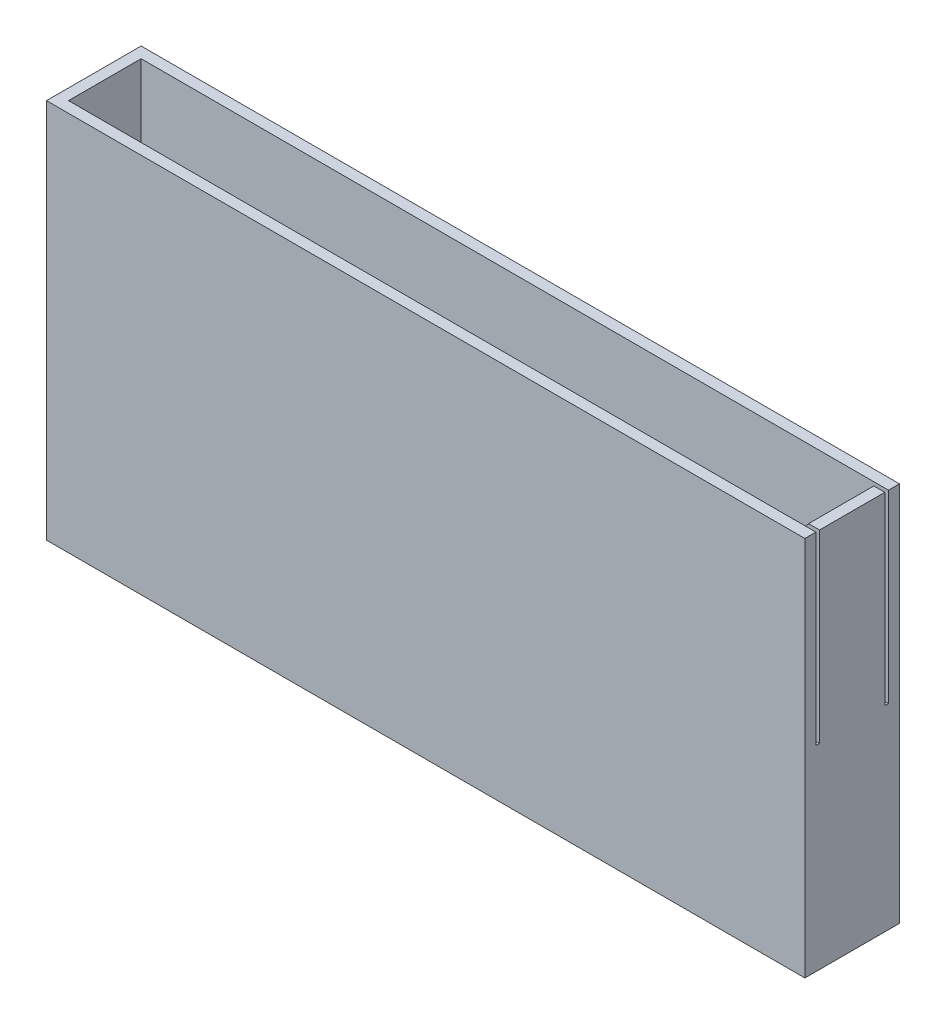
ISO-10303-21;
HEADER;
FILE_DESCRIPTION(('STEP AP214'),'2;1');
FILE_NAME('part.step','',(''),(''),'','','');
FILE_SCHEMA(('AUTOMOTIVE_DESIGN { 1 0 10303 214 1 1 1 1 }'));
ENDSEC;
DATA;
#1=APPLICATION_CONTEXT('core data for automotive mechanical design processes');
#2=APPLICATION_PROTOCOL_DEFINITION('international standard','automotive_design',2000,#1);
#3=PRODUCT_CONTEXT('',#1,'mechanical');
#4=PRODUCT('Part','Part','',(#3));
#5=PRODUCT_RELATED_PRODUCT_CATEGORY('part','',(#4));
#6=PRODUCT_DEFINITION_FORMATION('','',#4);
#7=PRODUCT_DEFINITION_CONTEXT('part definition',#1,'design');
#8=PRODUCT_DEFINITION('design','',#6,#7);
#9=PRODUCT_DEFINITION_SHAPE('','',#8);
#10=(LENGTH_UNIT() NAMED_UNIT(*) SI_UNIT(.MILLI.,.METRE.));
#11=(NAMED_UNIT(*) PLANE_ANGLE_UNIT() SI_UNIT($,.RADIAN.));
#12=(NAMED_UNIT(*) SI_UNIT($,.STERADIAN.) SOLID_ANGLE_UNIT());
#13=UNCERTAINTY_MEASURE_WITH_UNIT(LENGTH_MEASURE(1.E-05),#10,'distance_accuracy_value','');
#14=(GEOMETRIC_REPRESENTATION_CONTEXT(3) GLOBAL_UNCERTAINTY_ASSIGNED_CONTEXT((#13)) GLOBAL_UNIT_ASSIGNED_CONTEXT((#10,
#11,#12)) REPRESENTATION_CONTEXT('',''));
#15=CARTESIAN_POINT('',(0.,0.,0.));
#16=DIRECTION('',(0.,0.,1.));
#17=DIRECTION('',(1.,0.,0.));
#18=AXIS2_PLACEMENT_3D('',#15,#16,#17);
#19=CARTESIAN_POINT('',(0.,50.4,0.));
#20=DIRECTION('',(0.,-1.,0.));
#21=DIRECTION('',(0.,0.,-1.));
#22=AXIS2_PLACEMENT_3D('',#19,#20,#21);
#23=PLANE('',#22);
#24=DIRECTION('',(-1.,0.,0.));
#25=VECTOR('',#24,1.);
#26=CARTESIAN_POINT('',(1.5,50.4,-11.4));
#27=LINE('',#26,#25);
#28=CARTESIAN_POINT('',(103.4,50.4,-11.4));
#29=VERTEX_POINT('',#28);
#30=CARTESIAN_POINT('',(1.5,50.4,-11.4));
#31=VERTEX_POINT('',#30);
#32=EDGE_CURVE('E199',#29,#31,#27,.T.);
#33=ORIENTED_EDGE('',*,*,#32,.F.);
#34=DIRECTION('',(0.,0.,-1.));
#35=VECTOR('',#34,1.);
#36=CARTESIAN_POINT('',(103.4,50.4,0.));
#37=LINE('',#36,#35);
#38=CARTESIAN_POINT('',(103.4,50.4,-12.9));
#39=VERTEX_POINT('',#38);
#40=EDGE_CURVE('E235',#29,#39,#37,.T.);
#41=ORIENTED_EDGE('',*,*,#40,.T.);
#42=DIRECTION('',(-1.,0.,0.));
#43=VECTOR('',#42,1.);
#44=CARTESIAN_POINT('',(0.,50.4,-12.9));
#45=LINE('',#44,#43);
#46=CARTESIAN_POINT('',(0.,50.4,-12.9));
#47=VERTEX_POINT('',#46);
#48=EDGE_CURVE('E229',#39,#47,#45,.T.);
#49=ORIENTED_EDGE('',*,*,#48,.T.);
#50=DIRECTION('',(0.,0.,1.));
#51=VECTOR('',#50,1.);
#52=CARTESIAN_POINT('',(0.,50.4,0.));
#53=LINE('',#52,#51);
#54=CARTESIAN_POINT('',(0.,50.4,0.));
#55=VERTEX_POINT('',#54);
#56=EDGE_CURVE('E238',#47,#55,#53,.T.);
#57=ORIENTED_EDGE('',*,*,#56,.T.);
#58=DIRECTION('',(1.,0.,0.));
#59=VECTOR('',#58,1.);
#60=CARTESIAN_POINT('',(0.,50.4,0.));
#61=LINE('',#60,#59);
#62=CARTESIAN_POINT('',(103.4,50.4,0.));
#63=VERTEX_POINT('',#62);
#64=EDGE_CURVE('E236',#55,#63,#61,.T.);
#65=ORIENTED_EDGE('',*,*,#64,.T.);
#66=CARTESIAN_POINT('',(103.4,50.4,-1.5));
#67=VERTEX_POINT('',#66);
#68=EDGE_CURVE('E231',#63,#67,#37,.T.);
#69=ORIENTED_EDGE('',*,*,#68,.T.);
#70=DIRECTION('',(1.,0.,0.));
#71=VECTOR('',#70,1.);
#72=CARTESIAN_POINT('',(1.5,50.4,-1.5));
#73=LINE('',#72,#71);
#74=CARTESIAN_POINT('',(1.5,50.4,-1.5));
#75=VERTEX_POINT('',#74);
#76=EDGE_CURVE('E200',#75,#67,#73,.T.);
#77=ORIENTED_EDGE('',*,*,#76,.F.);
#78=DIRECTION('',(0.,0.,1.));
#79=VECTOR('',#78,1.);
#80=CARTESIAN_POINT('',(1.5,50.4,-1.5));
#81=LINE('',#80,#79);
#82=EDGE_CURVE('E204',#31,#75,#81,.T.);
#83=ORIENTED_EDGE('',*,*,#82,.F.);
#84=EDGE_LOOP('',(#33,#41,#49,#57,#65,#69,#77,#83));
#85=FACE_BOUND('',#84,.T.);
#86=ADVANCED_FACE('F32',(#85),#23,.F.);
#87=CARTESIAN_POINT('',(0.,0.,0.));
#88=DIRECTION('',(0.,-1.,0.));
#89=DIRECTION('',(0.,0.,-1.));
#90=AXIS2_PLACEMENT_3D('',#87,#88,#89);
#91=PLANE('',#90);
#92=DIRECTION('',(0.,0.,1.));
#93=VECTOR('',#92,1.);
#94=CARTESIAN_POINT('',(10.5,0.,-11.4));
#95=LINE('',#94,#93);
#96=CARTESIAN_POINT('',(10.5,0.,-11.4));
#97=VERTEX_POINT('',#96);
#98=CARTESIAN_POINT('',(10.5,0.,-1.5));
#99=VERTEX_POINT('',#98);
#100=EDGE_CURVE('E290',#97,#99,#95,.T.);
#101=ORIENTED_EDGE('',*,*,#100,.F.);
#102=DIRECTION('',(-1.,0.,0.));
#103=VECTOR('',#102,1.);
#104=CARTESIAN_POINT('',(1.5,0.,-11.4));
#105=LINE('',#104,#103);
#106=CARTESIAN_POINT('',(1.5,0.,-11.4));
#107=VERTEX_POINT('',#106);
#108=EDGE_CURVE('E252',#97,#107,#105,.T.);
#109=ORIENTED_EDGE('',*,*,#108,.T.);
#110=DIRECTION('',(0.,0.,1.));
#111=VECTOR('',#110,1.);
#112=CARTESIAN_POINT('',(1.5,0.,-1.5));
#113=LINE('',#112,#111);
#114=CARTESIAN_POINT('',(1.5,0.,-1.5));
#115=VERTEX_POINT('',#114);
#116=EDGE_CURVE('E208',#107,#115,#113,.T.);
#117=ORIENTED_EDGE('',*,*,#116,.T.);
#118=DIRECTION('',(1.,0.,0.));
#119=VECTOR('',#118,1.);
#120=CARTESIAN_POINT('',(1.5,0.,-1.5));
#121=LINE('',#120,#119);
#122=EDGE_CURVE('E221',#115,#99,#121,.T.);
#123=ORIENTED_EDGE('',*,*,#122,.T.);
#124=EDGE_LOOP('',(#101,#109,#117,#123));
#125=FACE_BOUND('',#124,.T.);
#126=ADVANCED_FACE('F408',(#125),#91,.F.);
#127=DIRECTION('',(0.,0.,-1.));
#128=VECTOR('',#127,1.);
#129=CARTESIAN_POINT('',(92.9,0.,-11.4));
#130=LINE('',#129,#128);
#131=CARTESIAN_POINT('',(92.9,0.,-1.5));
#132=VERTEX_POINT('',#131);
#133=CARTESIAN_POINT('',(92.9,0.,-11.4));
#134=VERTEX_POINT('',#133);
#135=EDGE_CURVE('E287',#132,#134,#130,.T.);
#136=ORIENTED_EDGE('',*,*,#135,.F.);
#137=CARTESIAN_POINT('',(101.9,0.,-1.5));
#138=VERTEX_POINT('',#137);
#139=EDGE_CURVE('E211',#132,#138,#121,.T.);
#140=ORIENTED_EDGE('',*,*,#139,.T.);
#141=DIRECTION('',(0.,0.,-1.));
#142=VECTOR('',#141,1.);
#143=CARTESIAN_POINT('',(101.9,0.,-1.5));
#144=LINE('',#143,#142);
#145=CARTESIAN_POINT('',(101.9,0.,-11.4));
#146=VERTEX_POINT('',#145);
#147=EDGE_CURVE('E215',#138,#146,#144,.T.);
#148=ORIENTED_EDGE('',*,*,#147,.T.);
#149=EDGE_CURVE('E254',#146,#134,#105,.T.);
#150=ORIENTED_EDGE('',*,*,#149,.T.);
#151=EDGE_LOOP('',(#136,#140,#148,#150));
#152=FACE_BOUND('',#151,.T.);
#153=ADVANCED_FACE('F264',(#152),#91,.F.);
#154=CARTESIAN_POINT('',(103.4,50.4,-2.));
#155=VERTEX_POINT('',#154);
#156=CARTESIAN_POINT('',(103.4,50.4,-10.9));
#157=VERTEX_POINT('',#156);
#158=EDGE_CURVE('E234',#155,#157,#37,.T.);
#159=ORIENTED_EDGE('',*,*,#158,.T.);
#160=DIRECTION('',(-1.,0.,0.));
#161=VECTOR('',#160,1.);
#162=CARTESIAN_POINT('',(128.604959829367,50.4,-10.9));
#163=LINE('',#162,#161);
#164=CARTESIAN_POINT('',(101.9,50.4,-10.9));
#165=VERTEX_POINT('',#164);
#166=EDGE_CURVE('E198',#157,#165,#163,.T.);
#167=ORIENTED_EDGE('',*,*,#166,.T.);
#168=DIRECTION('',(0.,0.,-1.));
#169=VECTOR('',#168,1.);
#170=CARTESIAN_POINT('',(101.9,50.4,-1.5));
#171=LINE('',#170,#169);
#172=CARTESIAN_POINT('',(101.9,50.4,-2.));
#173=VERTEX_POINT('',#172);
#174=EDGE_CURVE('E175',#173,#165,#171,.T.);
#175=ORIENTED_EDGE('',*,*,#174,.F.);
#176=DIRECTION('',(-1.,0.,0.));
#177=VECTOR('',#176,1.);
#178=CARTESIAN_POINT('',(128.604959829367,50.4,-2.));
#179=LINE('',#178,#177);
#180=EDGE_CURVE('E185',#155,#173,#179,.T.);
#181=ORIENTED_EDGE('',*,*,#180,.F.);
#182=EDGE_LOOP('',(#159,#167,#175,#181));
#183=FACE_BOUND('',#182,.T.);
#184=ADVANCED_FACE('F197',(#183),#23,.F.);
#185=CARTESIAN_POINT('',(0.,50.4,0.));
#186=DIRECTION('',(1.,0.,0.));
#187=DIRECTION('',(0.,0.,-1.));
#188=AXIS2_PLACEMENT_3D('',#185,#186,#187);
#189=PLANE('',#188);
#190=DIRECTION('',(0.,-1.,0.));
#191=VECTOR('',#190,1.);
#192=CARTESIAN_POINT('',(0.,50.4,-12.9));
#193=LINE('',#192,#191);
#194=CARTESIAN_POINT('',(0.,-1.5,-12.9));
#195=VERTEX_POINT('',#194);
#196=EDGE_CURVE('E227',#47,#195,#193,.T.);
#197=ORIENTED_EDGE('',*,*,#196,.T.);
#198=DIRECTION('',(0.,0.,-1.));
#199=VECTOR('',#198,1.);
#200=CARTESIAN_POINT('',(0.,-1.5,0.));
#201=LINE('',#200,#199);
#202=CARTESIAN_POINT('',(0.,-1.5,0.));
#203=VERTEX_POINT('',#202);
#204=EDGE_CURVE('E306',#203,#195,#201,.T.);
#205=ORIENTED_EDGE('',*,*,#204,.F.);
#206=DIRECTION('',(0.,-1.,0.));
#207=VECTOR('',#206,1.);
#208=CARTESIAN_POINT('',(0.,50.4,0.));
#209=LINE('',#208,#207);
#210=EDGE_CURVE('E11',#55,#203,#209,.T.);
#211=ORIENTED_EDGE('',*,*,#210,.F.);
#212=ORIENTED_EDGE('',*,*,#56,.F.);
#213=EDGE_LOOP('',(#197,#205,#211,#212));
#214=FACE_BOUND('',#213,.T.);
#215=ADVANCED_FACE('F34',(#214),#189,.F.);
#216=CARTESIAN_POINT('',(0.,50.4,0.));
#217=DIRECTION('',(0.,0.,-1.));
#218=DIRECTION('',(-1.,0.,0.));
#219=AXIS2_PLACEMENT_3D('',#216,#217,#218);
#220=PLANE('',#219);
#221=ORIENTED_EDGE('',*,*,#210,.T.);
#222=DIRECTION('',(-1.,0.,0.));
#223=VECTOR('',#222,1.);
#224=CARTESIAN_POINT('',(0.,-1.5,0.));
#225=LINE('',#224,#223);
#226=CARTESIAN_POINT('',(103.4,-1.5,0.));
#227=VERTEX_POINT('',#226);
#228=EDGE_CURVE('E212',#227,#203,#225,.T.);
#229=ORIENTED_EDGE('',*,*,#228,.F.);
#230=DIRECTION('',(0.,-1.,0.));
#231=VECTOR('',#230,1.);
#232=CARTESIAN_POINT('',(103.4,50.4,0.));
#233=LINE('',#232,#231);
#234=EDGE_CURVE('E41',#63,#227,#233,.T.);
#235=ORIENTED_EDGE('',*,*,#234,.F.);
#236=ORIENTED_EDGE('',*,*,#64,.F.);
#237=EDGE_LOOP('',(#221,#229,#235,#236));
#238=FACE_BOUND('',#237,.T.);
#239=ADVANCED_FACE('F345',(#238),#220,.F.);
#240=CARTESIAN_POINT('',(103.4,50.4,0.));
#241=DIRECTION('',(-1.,0.,0.));
#242=DIRECTION('',(0.,0.,1.));
#243=AXIS2_PLACEMENT_3D('',#240,#241,#242);
#244=PLANE('',#243);
#245=ORIENTED_EDGE('',*,*,#40,.F.);
#246=DIRECTION('',(0.,1.,0.));
#247=VECTOR('',#246,1.);
#248=CARTESIAN_POINT('',(103.4,25.2,-11.4));
#249=LINE('',#248,#247);
#250=CARTESIAN_POINT('',(103.4,25.2,-11.4));
#251=VERTEX_POINT('',#250);
#252=EDGE_CURVE('E357',#251,#29,#249,.T.);
#253=ORIENTED_EDGE('',*,*,#252,.F.);
#254=DIRECTION('',(0.,0.,-1.));
#255=VECTOR('',#254,1.);
#256=CARTESIAN_POINT('',(103.4,25.2,-11.4));
#257=LINE('',#256,#255);
#258=CARTESIAN_POINT('',(103.4,25.2,-10.9));
#259=VERTEX_POINT('',#258);
#260=EDGE_CURVE('E354',#259,#251,#257,.T.);
#261=ORIENTED_EDGE('',*,*,#260,.F.);
#262=DIRECTION('',(0.,-1.,0.));
#263=VECTOR('',#262,1.);
#264=CARTESIAN_POINT('',(103.4,25.2,-10.9));
#265=LINE('',#264,#263);
#266=EDGE_CURVE('E353',#157,#259,#265,.T.);
#267=ORIENTED_EDGE('',*,*,#266,.F.);
#268=ORIENTED_EDGE('',*,*,#158,.F.);
#269=DIRECTION('',(0.,1.,0.));
#270=VECTOR('',#269,1.);
#271=CARTESIAN_POINT('',(103.4,25.2,-2.));
#272=LINE('',#271,#270);
#273=CARTESIAN_POINT('',(103.4,25.2,-2.));
#274=VERTEX_POINT('',#273);
#275=EDGE_CURVE('E189',#274,#155,#272,.T.);
#276=ORIENTED_EDGE('',*,*,#275,.F.);
#277=DIRECTION('',(0.,0.,-1.));
#278=VECTOR('',#277,1.);
#279=CARTESIAN_POINT('',(103.4,25.2,-1.5));
#280=LINE('',#279,#278);
#281=CARTESIAN_POINT('',(103.4,25.2,-1.5));
#282=VERTEX_POINT('',#281);
#283=EDGE_CURVE('E376',#282,#274,#280,.T.);
#284=ORIENTED_EDGE('',*,*,#283,.F.);
#285=DIRECTION('',(0.,-1.,0.));
#286=VECTOR('',#285,1.);
#287=CARTESIAN_POINT('',(103.4,25.2,-1.5));
#288=LINE('',#287,#286);
#289=EDGE_CURVE('E293',#67,#282,#288,.T.);
#290=ORIENTED_EDGE('',*,*,#289,.F.);
#291=ORIENTED_EDGE('',*,*,#68,.F.);
#292=ORIENTED_EDGE('',*,*,#234,.T.);
#293=DIRECTION('',(0.,0.,1.));
#294=VECTOR('',#293,1.);
#295=CARTESIAN_POINT('',(103.4,-1.5,0.));
#296=LINE('',#295,#294);
#297=CARTESIAN_POINT('',(103.4,-1.5,-12.9));
#298=VERTEX_POINT('',#297);
#299=EDGE_CURVE('E320',#298,#227,#296,.T.);
#300=ORIENTED_EDGE('',*,*,#299,.F.);
#301=DIRECTION('',(0.,-1.,0.));
#302=VECTOR('',#301,1.);
#303=CARTESIAN_POINT('',(103.4,50.4,-12.9));
#304=LINE('',#303,#302);
#305=EDGE_CURVE('E225',#39,#298,#304,.T.);
#306=ORIENTED_EDGE('',*,*,#305,.F.);
#307=EDGE_LOOP('',(#245,#253,#261,#267,#268,#276,#284,#290,#291,#292,#300,#306));
#308=FACE_BOUND('',#307,.T.);
#309=ADVANCED_FACE('F342',(#308),#244,.F.);
#310=CARTESIAN_POINT('',(0.,50.4,-12.9));
#311=DIRECTION('',(0.,0.,1.));
#312=DIRECTION('',(1.,0.,0.));
#313=AXIS2_PLACEMENT_3D('',#310,#311,#312);
#314=PLANE('',#313);
#315=ORIENTED_EDGE('',*,*,#305,.T.);
#316=DIRECTION('',(1.,0.,0.));
#317=VECTOR('',#316,1.);
#318=CARTESIAN_POINT('',(0.,-1.5,-12.9));
#319=LINE('',#318,#317);
#320=EDGE_CURVE('E310',#195,#298,#319,.T.);
#321=ORIENTED_EDGE('',*,*,#320,.F.);
#322=ORIENTED_EDGE('',*,*,#196,.F.);
#323=ORIENTED_EDGE('',*,*,#48,.F.);
#324=EDGE_LOOP('',(#315,#321,#322,#323));
#325=FACE_BOUND('',#324,.T.);
#326=ADVANCED_FACE('F338',(#325),#314,.F.);
#327=CARTESIAN_POINT('',(1.5,50.4,-1.5));
#328=DIRECTION('',(1.,0.,0.));
#329=DIRECTION('',(0.,0.,-1.));
#330=AXIS2_PLACEMENT_3D('',#327,#328,#329);
#331=PLANE('',#330);
#332=ORIENTED_EDGE('',*,*,#116,.F.);
#333=DIRECTION('',(0.,-1.,0.));
#334=VECTOR('',#333,1.);
#335=CARTESIAN_POINT('',(1.5,50.4,-11.4));
#336=LINE('',#335,#334);
#337=EDGE_CURVE('E202',#31,#107,#336,.T.);
#338=ORIENTED_EDGE('',*,*,#337,.F.);
#339=ORIENTED_EDGE('',*,*,#82,.T.);
#340=DIRECTION('',(0.,-1.,0.));
#341=VECTOR('',#340,1.);
#342=CARTESIAN_POINT('',(1.5,50.4,-1.5));
#343=LINE('',#342,#341);
#344=EDGE_CURVE('E241',#75,#115,#343,.T.);
#345=ORIENTED_EDGE('',*,*,#344,.T.);
#346=EDGE_LOOP('',(#332,#338,#339,#345));
#347=FACE_BOUND('',#346,.T.);
#348=ADVANCED_FACE('F432',(#347),#331,.T.);
#349=CARTESIAN_POINT('',(1.5,50.4,-1.5));
#350=DIRECTION('',(0.,0.,-1.));
#351=DIRECTION('',(-1.,0.,0.));
#352=AXIS2_PLACEMENT_3D('',#349,#350,#351);
#353=PLANE('',#352);
#354=ORIENTED_EDGE('',*,*,#122,.F.);
#355=ORIENTED_EDGE('',*,*,#344,.F.);
#356=ORIENTED_EDGE('',*,*,#76,.T.);
#357=ORIENTED_EDGE('',*,*,#289,.T.);
#358=DIRECTION('',(-1.,0.,0.));
#359=VECTOR('',#358,1.);
#360=CARTESIAN_POINT('',(128.604959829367,25.2,-1.5));
#361=LINE('',#360,#359);
#362=CARTESIAN_POINT('',(101.9,25.2,-1.5));
#363=VERTEX_POINT('',#362);
#364=EDGE_CURVE('E377',#282,#363,#361,.T.);
#365=ORIENTED_EDGE('',*,*,#364,.T.);
#366=DIRECTION('',(0.,-1.,0.));
#367=VECTOR('',#366,1.);
#368=CARTESIAN_POINT('',(101.9,50.4,-1.5));
#369=LINE('',#368,#367);
#370=EDGE_CURVE('E244',#363,#138,#369,.T.);
#371=ORIENTED_EDGE('',*,*,#370,.T.);
#372=ORIENTED_EDGE('',*,*,#139,.F.);
#373=DIRECTION('',(0.,1.,0.));
#374=VECTOR('',#373,1.);
#375=CARTESIAN_POINT('',(92.9,-84.4925900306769,-1.5));
#376=LINE('',#375,#374);
#377=CARTESIAN_POINT('',(92.9,-1.5,-1.5));
#378=VERTEX_POINT('',#377);
#379=EDGE_CURVE('E49',#378,#132,#376,.T.);
#380=ORIENTED_EDGE('',*,*,#379,.F.);
#381=DIRECTION('',(1.,0.,0.));
#382=VECTOR('',#381,1.);
#383=CARTESIAN_POINT('',(10.5,-1.5,-1.5));
#384=LINE('',#383,#382);
#385=CARTESIAN_POINT('',(10.5,-1.5,-1.5));
#386=VERTEX_POINT('',#385);
#387=EDGE_CURVE('E289',#386,#378,#384,.T.);
#388=ORIENTED_EDGE('',*,*,#387,.F.);
#389=DIRECTION('',(0.,1.,0.));
#390=VECTOR('',#389,1.);
#391=CARTESIAN_POINT('',(10.5,-84.4925900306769,-1.5));
#392=LINE('',#391,#390);
#393=EDGE_CURVE('E57',#386,#99,#392,.T.);
#394=ORIENTED_EDGE('',*,*,#393,.T.);
#395=EDGE_LOOP('',(#354,#355,#356,#357,#365,#371,#372,#380,#388,#394));
#396=FACE_BOUND('',#395,.T.);
#397=ADVANCED_FACE('F430',(#396),#353,.T.);
#398=CARTESIAN_POINT('',(101.9,50.4,-1.5));
#399=DIRECTION('',(-1.,0.,0.));
#400=DIRECTION('',(0.,0.,1.));
#401=AXIS2_PLACEMENT_3D('',#398,#399,#400);
#402=PLANE('',#401);
#403=DIRECTION('',(0.,0.,1.));
#404=VECTOR('',#403,1.);
#405=CARTESIAN_POINT('',(101.9,47.9,-13.5925824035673));
#406=LINE('',#405,#404);
#407=CARTESIAN_POINT('',(101.9,47.9,-10.9));
#408=VERTEX_POINT('',#407);
#409=CARTESIAN_POINT('',(101.9,47.9,-2.));
#410=VERTEX_POINT('',#409);
#411=EDGE_CURVE('E388',#408,#410,#406,.T.);
#412=ORIENTED_EDGE('',*,*,#411,.F.);
#413=DIRECTION('',(0.,1.,0.));
#414=VECTOR('',#413,1.);
#415=CARTESIAN_POINT('',(101.9,25.2,-10.9));
#416=LINE('',#415,#414);
#417=CARTESIAN_POINT('',(101.9,25.2,-10.9));
#418=VERTEX_POINT('',#417);
#419=EDGE_CURVE('E367',#418,#408,#416,.T.);
#420=ORIENTED_EDGE('',*,*,#419,.F.);
#421=DIRECTION('',(0.,0.,1.));
#422=VECTOR('',#421,1.);
#423=CARTESIAN_POINT('',(101.9,25.2,-11.4));
#424=LINE('',#423,#422);
#425=CARTESIAN_POINT('',(101.9,25.2,-11.4));
#426=VERTEX_POINT('',#425);
#427=EDGE_CURVE('E275',#426,#418,#424,.T.);
#428=ORIENTED_EDGE('',*,*,#427,.F.);
#429=DIRECTION('',(0.,-1.,0.));
#430=VECTOR('',#429,1.);
#431=CARTESIAN_POINT('',(101.9,50.4,-11.4));
#432=LINE('',#431,#430);
#433=EDGE_CURVE('E246',#426,#146,#432,.T.);
#434=ORIENTED_EDGE('',*,*,#433,.T.);
#435=ORIENTED_EDGE('',*,*,#147,.F.);
#436=ORIENTED_EDGE('',*,*,#370,.F.);
#437=DIRECTION('',(0.,0.,1.));
#438=VECTOR('',#437,1.);
#439=CARTESIAN_POINT('',(101.9,25.2,-1.5));
#440=LINE('',#439,#438);
#441=CARTESIAN_POINT('',(101.9,25.2,-2.));
#442=VERTEX_POINT('',#441);
#443=EDGE_CURVE('E194',#442,#363,#440,.T.);
#444=ORIENTED_EDGE('',*,*,#443,.F.);
#445=DIRECTION('',(0.,-1.,0.));
#446=VECTOR('',#445,1.);
#447=CARTESIAN_POINT('',(101.9,25.2,-2.));
#448=LINE('',#447,#446);
#449=EDGE_CURVE('E374',#410,#442,#448,.T.);
#450=ORIENTED_EDGE('',*,*,#449,.F.);
#451=EDGE_LOOP('',(#412,#420,#428,#434,#435,#436,#444,#450));
#452=FACE_BOUND('',#451,.T.);
#453=ADVANCED_FACE('F269',(#452),#402,.T.);
#454=CARTESIAN_POINT('',(1.5,50.4,-11.4));
#455=DIRECTION('',(0.,0.,1.));
#456=DIRECTION('',(1.,0.,0.));
#457=AXIS2_PLACEMENT_3D('',#454,#455,#456);
#458=PLANE('',#457);
#459=ORIENTED_EDGE('',*,*,#149,.F.);
#460=ORIENTED_EDGE('',*,*,#433,.F.);
#461=DIRECTION('',(-1.,0.,0.));
#462=VECTOR('',#461,1.);
#463=CARTESIAN_POINT('',(128.604959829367,25.2,-11.4));
#464=LINE('',#463,#462);
#465=EDGE_CURVE('E369',#251,#426,#464,.T.);
#466=ORIENTED_EDGE('',*,*,#465,.F.);
#467=ORIENTED_EDGE('',*,*,#252,.T.);
#468=ORIENTED_EDGE('',*,*,#32,.T.);
#469=ORIENTED_EDGE('',*,*,#337,.T.);
#470=ORIENTED_EDGE('',*,*,#108,.F.);
#471=DIRECTION('',(0.,1.,0.));
#472=VECTOR('',#471,1.);
#473=CARTESIAN_POINT('',(10.5,-84.4925900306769,-11.4));
#474=LINE('',#473,#472);
#475=CARTESIAN_POINT('',(10.5,-1.5,-11.4));
#476=VERTEX_POINT('',#475);
#477=EDGE_CURVE('E313',#476,#97,#474,.T.);
#478=ORIENTED_EDGE('',*,*,#477,.F.);
#479=DIRECTION('',(-1.,0.,0.));
#480=VECTOR('',#479,1.);
#481=CARTESIAN_POINT('',(10.5,-1.5,-11.4));
#482=LINE('',#481,#480);
#483=CARTESIAN_POINT('',(92.9,-1.5,-11.4));
#484=VERTEX_POINT('',#483);
#485=EDGE_CURVE('E283',#484,#476,#482,.T.);
#486=ORIENTED_EDGE('',*,*,#485,.F.);
#487=DIRECTION('',(0.,1.,0.));
#488=VECTOR('',#487,1.);
#489=CARTESIAN_POINT('',(92.9,-84.4925900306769,-11.4));
#490=LINE('',#489,#488);
#491=EDGE_CURVE('E280',#484,#134,#490,.T.);
#492=ORIENTED_EDGE('',*,*,#491,.T.);
#493=EDGE_LOOP('',(#459,#460,#466,#467,#468,#469,#470,#478,#486,#492));
#494=FACE_BOUND('',#493,.T.);
#495=ADVANCED_FACE('F278',(#494),#458,.T.);
#496=CARTESIAN_POINT('',(0.,-1.5,0.));
#497=DIRECTION('',(0.,-1.,0.));
#498=DIRECTION('',(0.,0.,-1.));
#499=AXIS2_PLACEMENT_3D('',#496,#497,#498);
#500=PLANE('',#499);
#501=ORIENTED_EDGE('',*,*,#387,.T.);
#502=DIRECTION('',(0.,0.,-1.));
#503=VECTOR('',#502,1.);
#504=CARTESIAN_POINT('',(92.9,-1.5,-11.4));
#505=LINE('',#504,#503);
#506=EDGE_CURVE('E285',#378,#484,#505,.T.);
#507=ORIENTED_EDGE('',*,*,#506,.T.);
#508=ORIENTED_EDGE('',*,*,#485,.T.);
#509=DIRECTION('',(0.,0.,1.));
#510=VECTOR('',#509,1.);
#511=CARTESIAN_POINT('',(10.5,-1.5,-11.4));
#512=LINE('',#511,#510);
#513=EDGE_CURVE('E307',#476,#386,#512,.T.);
#514=ORIENTED_EDGE('',*,*,#513,.T.);
#515=EDGE_LOOP('',(#501,#507,#508,#514));
#516=FACE_BOUND('',#515,.T.);
#517=ORIENTED_EDGE('',*,*,#204,.T.);
#518=ORIENTED_EDGE('',*,*,#320,.T.);
#519=ORIENTED_EDGE('',*,*,#299,.T.);
#520=ORIENTED_EDGE('',*,*,#228,.T.);
#521=EDGE_LOOP('',(#517,#518,#519,#520));
#522=FACE_BOUND('',#521,.T.);
#523=ADVANCED_FACE('F327',(#516,#522),#500,.T.);
#524=CARTESIAN_POINT('',(92.9,-84.4925900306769,-11.4));
#525=DIRECTION('',(1.,0.,0.));
#526=DIRECTION('',(0.,0.,-1.));
#527=AXIS2_PLACEMENT_3D('',#524,#525,#526);
#528=PLANE('',#527);
#529=ORIENTED_EDGE('',*,*,#379,.T.);
#530=ORIENTED_EDGE('',*,*,#135,.T.);
#531=ORIENTED_EDGE('',*,*,#491,.F.);
#532=ORIENTED_EDGE('',*,*,#506,.F.);
#533=EDGE_LOOP('',(#529,#530,#531,#532));
#534=FACE_BOUND('',#533,.T.);
#535=ADVANCED_FACE('F288',(#534),#528,.F.);
#536=CARTESIAN_POINT('',(10.5,-84.4925900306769,-11.4));
#537=DIRECTION('',(-1.,0.,0.));
#538=DIRECTION('',(0.,0.,1.));
#539=AXIS2_PLACEMENT_3D('',#536,#537,#538);
#540=PLANE('',#539);
#541=ORIENTED_EDGE('',*,*,#477,.T.);
#542=ORIENTED_EDGE('',*,*,#100,.T.);
#543=ORIENTED_EDGE('',*,*,#393,.F.);
#544=ORIENTED_EDGE('',*,*,#513,.F.);
#545=EDGE_LOOP('',(#541,#542,#543,#544));
#546=FACE_BOUND('',#545,.T.);
#547=ADVANCED_FACE('F446',(#546),#540,.F.);
#548=CARTESIAN_POINT('',(128.604959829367,25.2,-1.5));
#549=DIRECTION('',(0.,-1.,0.));
#550=DIRECTION('',(0.,0.,-1.));
#551=AXIS2_PLACEMENT_3D('',#548,#549,#550);
#552=PLANE('',#551);
#553=ORIENTED_EDGE('',*,*,#283,.T.);
#554=DIRECTION('',(-1.,0.,0.));
#555=VECTOR('',#554,1.);
#556=CARTESIAN_POINT('',(128.604959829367,25.2,-2.));
#557=LINE('',#556,#555);
#558=EDGE_CURVE('E193',#274,#442,#557,.T.);
#559=ORIENTED_EDGE('',*,*,#558,.T.);
#560=ORIENTED_EDGE('',*,*,#443,.T.);
#561=ORIENTED_EDGE('',*,*,#364,.F.);
#562=EDGE_LOOP('',(#553,#559,#560,#561));
#563=FACE_BOUND('',#562,.T.);
#564=ADVANCED_FACE('F385',(#563),#552,.F.);
#565=CARTESIAN_POINT('',(128.604959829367,25.2,-2.));
#566=DIRECTION('',(0.,0.,-1.));
#567=DIRECTION('',(-1.,0.,0.));
#568=AXIS2_PLACEMENT_3D('',#565,#566,#567);
#569=PLANE('',#568);
#570=ORIENTED_EDGE('',*,*,#275,.T.);
#571=ORIENTED_EDGE('',*,*,#180,.T.);
#572=DIRECTION('',(-0.624695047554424,-0.78086880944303,0.));
#573=VECTOR('',#572,1.);
#574=CARTESIAN_POINT('',(101.9,50.4,-2.));
#575=LINE('',#574,#573);
#576=CARTESIAN_POINT('',(100.9,49.15,-2.));
#577=VERTEX_POINT('',#576);
#578=EDGE_CURVE('E170',#173,#577,#575,.T.);
#579=ORIENTED_EDGE('',*,*,#578,.T.);
#580=DIRECTION('',(0.624695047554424,-0.78086880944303,0.));
#581=VECTOR('',#580,1.);
#582=CARTESIAN_POINT('',(100.9,49.15,-2.));
#583=LINE('',#582,#581);
#584=EDGE_CURVE('E182',#577,#410,#583,.T.);
#585=ORIENTED_EDGE('',*,*,#584,.T.);
#586=ORIENTED_EDGE('',*,*,#449,.T.);
#587=ORIENTED_EDGE('',*,*,#558,.F.);
#588=EDGE_LOOP('',(#570,#571,#579,#585,#586,#587));
#589=FACE_BOUND('',#588,.T.);
#590=ADVANCED_FACE('F186',(#589),#569,.F.);
#591=CARTESIAN_POINT('',(128.604959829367,25.2,-10.9));
#592=DIRECTION('',(0.,0.,1.));
#593=DIRECTION('',(1.,0.,0.));
#594=AXIS2_PLACEMENT_3D('',#591,#592,#593);
#595=PLANE('',#594);
#596=ORIENTED_EDGE('',*,*,#266,.T.);
#597=DIRECTION('',(-1.,0.,0.));
#598=VECTOR('',#597,1.);
#599=CARTESIAN_POINT('',(128.604959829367,25.2,-10.9));
#600=LINE('',#599,#598);
#601=EDGE_CURVE('E360',#259,#418,#600,.T.);
#602=ORIENTED_EDGE('',*,*,#601,.T.);
#603=ORIENTED_EDGE('',*,*,#419,.T.);
#604=DIRECTION('',(-0.624695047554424,0.78086880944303,0.));
#605=VECTOR('',#604,1.);
#606=CARTESIAN_POINT('',(100.9,49.15,-10.9));
#607=LINE('',#606,#605);
#608=CARTESIAN_POINT('',(100.9,49.15,-10.9));
#609=VERTEX_POINT('',#608);
#610=EDGE_CURVE('E393',#408,#609,#607,.T.);
#611=ORIENTED_EDGE('',*,*,#610,.T.);
#612=DIRECTION('',(0.624695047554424,0.78086880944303,0.));
#613=VECTOR('',#612,1.);
#614=CARTESIAN_POINT('',(101.9,50.4,-10.9));
#615=LINE('',#614,#613);
#616=EDGE_CURVE('E363',#609,#165,#615,.T.);
#617=ORIENTED_EDGE('',*,*,#616,.T.);
#618=ORIENTED_EDGE('',*,*,#166,.F.);
#619=EDGE_LOOP('',(#596,#602,#603,#611,#617,#618));
#620=FACE_BOUND('',#619,.T.);
#621=ADVANCED_FACE('F394',(#620),#595,.F.);
#622=CARTESIAN_POINT('',(128.604959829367,25.2,-11.4));
#623=DIRECTION('',(0.,-1.,0.));
#624=DIRECTION('',(0.,0.,-1.));
#625=AXIS2_PLACEMENT_3D('',#622,#623,#624);
#626=PLANE('',#625);
#627=ORIENTED_EDGE('',*,*,#260,.T.);
#628=ORIENTED_EDGE('',*,*,#465,.T.);
#629=ORIENTED_EDGE('',*,*,#427,.T.);
#630=ORIENTED_EDGE('',*,*,#601,.F.);
#631=EDGE_LOOP('',(#627,#628,#629,#630));
#632=FACE_BOUND('',#631,.T.);
#633=ADVANCED_FACE('F396',(#632),#626,.F.);
#634=CARTESIAN_POINT('',(100.9,49.15,-13.5925824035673));
#635=DIRECTION('',(-0.78086880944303,-0.624695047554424,0.));
#636=DIRECTION('',(0.624695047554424,-0.78086880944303,0.));
#637=AXIS2_PLACEMENT_3D('',#634,#635,#636);
#638=PLANE('',#637);
#639=ORIENTED_EDGE('',*,*,#610,.F.);
#640=ORIENTED_EDGE('',*,*,#411,.T.);
#641=ORIENTED_EDGE('',*,*,#584,.F.);
#642=DIRECTION('',(0.,0.,1.));
#643=VECTOR('',#642,1.);
#644=CARTESIAN_POINT('',(100.9,49.15,-13.5925824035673));
#645=LINE('',#644,#643);
#646=EDGE_CURVE('E178',#609,#577,#645,.T.);
#647=ORIENTED_EDGE('',*,*,#646,.F.);
#648=EDGE_LOOP('',(#639,#640,#641,#647));
#649=FACE_BOUND('',#648,.T.);
#650=ADVANCED_FACE('F402',(#649),#638,.T.);
#651=CARTESIAN_POINT('',(101.9,50.4,-13.5925824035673));
#652=DIRECTION('',(-0.78086880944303,0.624695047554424,0.));
#653=DIRECTION('',(-0.624695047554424,-0.78086880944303,0.));
#654=AXIS2_PLACEMENT_3D('',#651,#652,#653);
#655=PLANE('',#654);
#656=ORIENTED_EDGE('',*,*,#616,.F.);
#657=ORIENTED_EDGE('',*,*,#646,.T.);
#658=ORIENTED_EDGE('',*,*,#578,.F.);
#659=ORIENTED_EDGE('',*,*,#174,.T.);
#660=EDGE_LOOP('',(#656,#657,#658,#659));
#661=FACE_BOUND('',#660,.T.);
#662=ADVANCED_FACE('F173',(#661),#655,.T.);
#663=CLOSED_SHELL('',(#86,#126,#153,#184,#215,#239,#309,#326,#348,#397,#453,#495,#523,#535,#547,
#564,#590,#621,#633,#650,#662));
#664=MANIFOLD_SOLID_BREP('B2',#663);
#665=ADVANCED_BREP_SHAPE_REPRESENTATION('',(#18,#664),#14);
#666=SHAPE_DEFINITION_REPRESENTATION(#9,#665);
ENDSEC;
END-ISO-10303-21;
